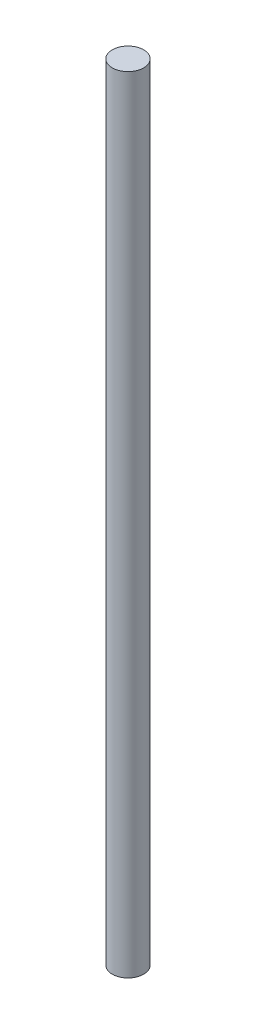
from build123d import *

# Parameters (mm, degrees)
SKETCH1_R           = 6
BOSS_EXTRUDE1_DEPTH = 300


with BuildPart() as part:
    # Sketch1 → Boss-Extrude1 (new body)
    with BuildSketch(Plane(origin=(0, 0, 0), x_dir=(1, 0, 0), z_dir=(0, 1, 0))):
        with Locations(Location((0, 0, 0), (0, 0, 270))):
            Circle(SKETCH1_R)
    extrude(amount=BOSS_EXTRUDE1_DEPTH)


solid = part.part
